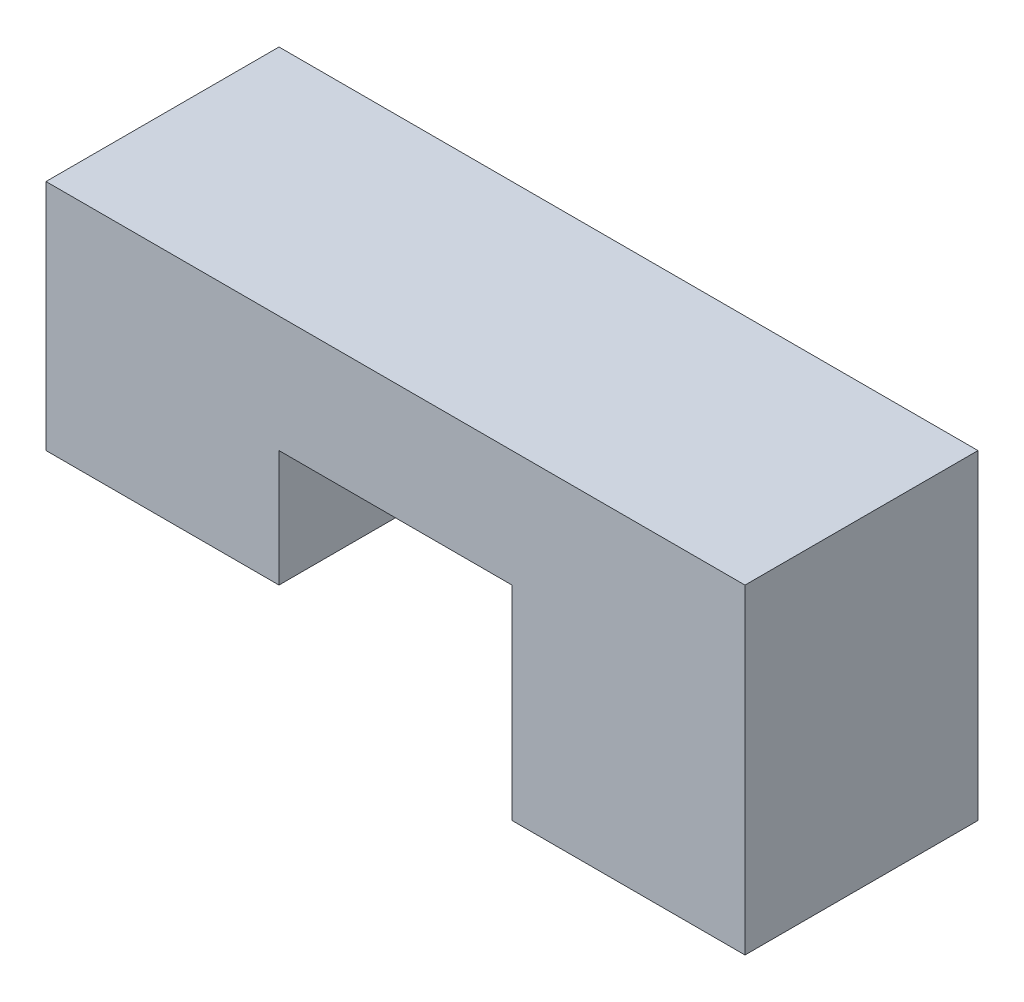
ISO-10303-21;
HEADER;
FILE_DESCRIPTION(('STEP AP214'),'2;1');
FILE_NAME('part.step','',(''),(''),'','','');
FILE_SCHEMA(('AUTOMOTIVE_DESIGN { 1 0 10303 214 1 1 1 1 }'));
ENDSEC;
DATA;
#1=APPLICATION_CONTEXT('core data for automotive mechanical design processes');
#2=APPLICATION_PROTOCOL_DEFINITION('international standard','automotive_design',2000,#1);
#3=PRODUCT_CONTEXT('',#1,'mechanical');
#4=PRODUCT('Part','Part','',(#3));
#5=PRODUCT_RELATED_PRODUCT_CATEGORY('part','',(#4));
#6=PRODUCT_DEFINITION_FORMATION('','',#4);
#7=PRODUCT_DEFINITION_CONTEXT('part definition',#1,'design');
#8=PRODUCT_DEFINITION('design','',#6,#7);
#9=PRODUCT_DEFINITION_SHAPE('','',#8);
#10=(LENGTH_UNIT() NAMED_UNIT(*) SI_UNIT(.MILLI.,.METRE.));
#11=(NAMED_UNIT(*) PLANE_ANGLE_UNIT() SI_UNIT($,.RADIAN.));
#12=(NAMED_UNIT(*) SI_UNIT($,.STERADIAN.) SOLID_ANGLE_UNIT());
#13=UNCERTAINTY_MEASURE_WITH_UNIT(LENGTH_MEASURE(1.E-05),#10,'distance_accuracy_value','');
#14=(GEOMETRIC_REPRESENTATION_CONTEXT(3) GLOBAL_UNCERTAINTY_ASSIGNED_CONTEXT((#13)) GLOBAL_UNIT_ASSIGNED_CONTEXT((#10,
#11,#12)) REPRESENTATION_CONTEXT('',''));
#15=CARTESIAN_POINT('',(0.,0.,0.));
#16=DIRECTION('',(0.,0.,1.));
#17=DIRECTION('',(1.,0.,0.));
#18=AXIS2_PLACEMENT_3D('',#15,#16,#17);
#19=CARTESIAN_POINT('',(-60.,-20.,20.));
#20=DIRECTION('',(-1.,0.,0.));
#21=DIRECTION('',(0.,0.,1.));
#22=AXIS2_PLACEMENT_3D('',#19,#20,#21);
#23=PLANE('',#22);
#24=DIRECTION('',(0.,0.,1.));
#25=VECTOR('',#24,1.);
#26=CARTESIAN_POINT('',(-60.,0.,20.));
#27=LINE('',#26,#25);
#28=CARTESIAN_POINT('',(-60.,0.,-20.));
#29=VERTEX_POINT('',#28);
#30=CARTESIAN_POINT('',(-60.,0.,20.));
#31=VERTEX_POINT('',#30);
#32=EDGE_CURVE('E144',#29,#31,#27,.T.);
#33=ORIENTED_EDGE('',*,*,#32,.F.);
#34=DIRECTION('',(0.,1.,0.));
#35=VECTOR('',#34,1.);
#36=CARTESIAN_POINT('',(-60.,-20.,-20.));
#37=LINE('',#36,#35);
#38=CARTESIAN_POINT('',(-60.,-40.,-20.));
#39=VERTEX_POINT('',#38);
#40=EDGE_CURVE('E157',#39,#29,#37,.T.);
#41=ORIENTED_EDGE('',*,*,#40,.F.);
#42=DIRECTION('',(0.,0.,1.));
#43=VECTOR('',#42,1.);
#44=CARTESIAN_POINT('',(-60.,-40.,20.));
#45=LINE('',#44,#43);
#46=CARTESIAN_POINT('',(-60.,-40.,20.));
#47=VERTEX_POINT('',#46);
#48=EDGE_CURVE('E126',#39,#47,#45,.T.);
#49=ORIENTED_EDGE('',*,*,#48,.T.);
#50=DIRECTION('',(0.,1.,0.));
#51=VECTOR('',#50,1.);
#52=CARTESIAN_POINT('',(-60.,-20.,20.));
#53=LINE('',#52,#51);
#54=EDGE_CURVE('E147',#47,#31,#53,.T.);
#55=ORIENTED_EDGE('',*,*,#54,.T.);
#56=EDGE_LOOP('',(#33,#41,#49,#55));
#57=FACE_BOUND('',#56,.T.);
#58=ADVANCED_FACE('F39',(#57),#23,.T.);
#59=CARTESIAN_POINT('',(-60.,-20.,-20.));
#60=DIRECTION('',(0.,0.,-1.));
#61=DIRECTION('',(-1.,0.,0.));
#62=AXIS2_PLACEMENT_3D('',#59,#60,#61);
#63=PLANE('',#62);
#64=ORIENTED_EDGE('',*,*,#40,.T.);
#65=DIRECTION('',(-1.,0.,0.));
#66=VECTOR('',#65,1.);
#67=CARTESIAN_POINT('',(-60.,0.,-20.));
#68=LINE('',#67,#66);
#69=CARTESIAN_POINT('',(60.,0.,-20.));
#70=VERTEX_POINT('',#69);
#71=EDGE_CURVE('E146',#70,#29,#68,.T.);
#72=ORIENTED_EDGE('',*,*,#71,.F.);
#73=DIRECTION('',(0.,1.,0.));
#74=VECTOR('',#73,1.);
#75=CARTESIAN_POINT('',(60.,-20.,-20.));
#76=LINE('',#75,#74);
#77=CARTESIAN_POINT('',(60.,-55.,-20.));
#78=VERTEX_POINT('',#77);
#79=EDGE_CURVE('E165',#78,#70,#76,.T.);
#80=ORIENTED_EDGE('',*,*,#79,.F.);
#81=DIRECTION('',(-1.,0.,0.));
#82=VECTOR('',#81,1.);
#83=CARTESIAN_POINT('',(20.,-55.,-20.));
#84=LINE('',#83,#82);
#85=CARTESIAN_POINT('',(20.,-55.,-20.));
#86=VERTEX_POINT('',#85);
#87=EDGE_CURVE('E112',#78,#86,#84,.T.);
#88=ORIENTED_EDGE('',*,*,#87,.T.);
#89=DIRECTION('',(0.,1.,0.));
#90=VECTOR('',#89,1.);
#91=CARTESIAN_POINT('',(20.,-55.,-20.));
#92=LINE('',#91,#90);
#93=CARTESIAN_POINT('',(20.,-20.,-20.));
#94=VERTEX_POINT('',#93);
#95=EDGE_CURVE('E109',#86,#94,#92,.T.);
#96=ORIENTED_EDGE('',*,*,#95,.T.);
#97=DIRECTION('',(-1.,0.,0.));
#98=VECTOR('',#97,1.);
#99=CARTESIAN_POINT('',(-60.,-20.,-20.));
#100=LINE('',#99,#98);
#101=CARTESIAN_POINT('',(-20.,-20.,-20.));
#102=VERTEX_POINT('',#101);
#103=EDGE_CURVE('E59',#94,#102,#100,.T.);
#104=ORIENTED_EDGE('',*,*,#103,.T.);
#105=DIRECTION('',(0.,1.,0.));
#106=VECTOR('',#105,1.);
#107=CARTESIAN_POINT('',(-20.,-40.,-20.));
#108=LINE('',#107,#106);
#109=CARTESIAN_POINT('',(-20.,-40.,-20.));
#110=VERTEX_POINT('',#109);
#111=EDGE_CURVE('E142',#110,#102,#108,.T.);
#112=ORIENTED_EDGE('',*,*,#111,.F.);
#113=DIRECTION('',(-1.,0.,0.));
#114=VECTOR('',#113,1.);
#115=CARTESIAN_POINT('',(-60.,-40.,-20.));
#116=LINE('',#115,#114);
#117=EDGE_CURVE('E137',#110,#39,#116,.T.);
#118=ORIENTED_EDGE('',*,*,#117,.T.);
#119=EDGE_LOOP('',(#64,#72,#80,#88,#96,#104,#112,#118));
#120=FACE_BOUND('',#119,.T.);
#121=ADVANCED_FACE('F179',(#120),#63,.T.);
#122=CARTESIAN_POINT('',(60.,-20.,20.));
#123=DIRECTION('',(1.,0.,0.));
#124=DIRECTION('',(0.,0.,-1.));
#125=AXIS2_PLACEMENT_3D('',#122,#123,#124);
#126=PLANE('',#125);
#127=DIRECTION('',(0.,0.,-1.));
#128=VECTOR('',#127,1.);
#129=CARTESIAN_POINT('',(60.,0.,20.));
#130=LINE('',#129,#128);
#131=CARTESIAN_POINT('',(60.,0.,20.));
#132=VERTEX_POINT('',#131);
#133=EDGE_CURVE('E154',#132,#70,#130,.T.);
#134=ORIENTED_EDGE('',*,*,#133,.F.);
#135=DIRECTION('',(0.,1.,0.));
#136=VECTOR('',#135,1.);
#137=CARTESIAN_POINT('',(60.,-20.,20.));
#138=LINE('',#137,#136);
#139=CARTESIAN_POINT('',(60.,-55.,20.));
#140=VERTEX_POINT('',#139);
#141=EDGE_CURVE('E163',#140,#132,#138,.T.);
#142=ORIENTED_EDGE('',*,*,#141,.F.);
#143=DIRECTION('',(0.,0.,-1.));
#144=VECTOR('',#143,1.);
#145=CARTESIAN_POINT('',(60.,-55.,20.));
#146=LINE('',#145,#144);
#147=EDGE_CURVE('E123',#140,#78,#146,.T.);
#148=ORIENTED_EDGE('',*,*,#147,.T.);
#149=ORIENTED_EDGE('',*,*,#79,.T.);
#150=EDGE_LOOP('',(#134,#142,#148,#149));
#151=FACE_BOUND('',#150,.T.);
#152=ADVANCED_FACE('F184',(#151),#126,.T.);
#153=CARTESIAN_POINT('',(-60.,-20.,20.));
#154=DIRECTION('',(0.,0.,1.));
#155=DIRECTION('',(1.,0.,0.));
#156=AXIS2_PLACEMENT_3D('',#153,#154,#155);
#157=PLANE('',#156);
#158=ORIENTED_EDGE('',*,*,#141,.T.);
#159=DIRECTION('',(1.,0.,0.));
#160=VECTOR('',#159,1.);
#161=CARTESIAN_POINT('',(-60.,0.,20.));
#162=LINE('',#161,#160);
#163=EDGE_CURVE('E153',#31,#132,#162,.T.);
#164=ORIENTED_EDGE('',*,*,#163,.F.);
#165=ORIENTED_EDGE('',*,*,#54,.F.);
#166=DIRECTION('',(1.,0.,0.));
#167=VECTOR('',#166,1.);
#168=CARTESIAN_POINT('',(-60.,-40.,20.));
#169=LINE('',#168,#167);
#170=CARTESIAN_POINT('',(-20.,-40.,20.));
#171=VERTEX_POINT('',#170);
#172=EDGE_CURVE('E134',#47,#171,#169,.T.);
#173=ORIENTED_EDGE('',*,*,#172,.T.);
#174=DIRECTION('',(0.,1.,0.));
#175=VECTOR('',#174,1.);
#176=CARTESIAN_POINT('',(-20.,-40.,20.));
#177=LINE('',#176,#175);
#178=CARTESIAN_POINT('',(-20.,-20.,20.));
#179=VERTEX_POINT('',#178);
#180=EDGE_CURVE('E143',#171,#179,#177,.T.);
#181=ORIENTED_EDGE('',*,*,#180,.T.);
#182=DIRECTION('',(1.,0.,0.));
#183=VECTOR('',#182,1.);
#184=CARTESIAN_POINT('',(-60.,-20.,20.));
#185=LINE('',#184,#183);
#186=CARTESIAN_POINT('',(20.,-20.,20.));
#187=VERTEX_POINT('',#186);
#188=EDGE_CURVE('E110',#179,#187,#185,.T.);
#189=ORIENTED_EDGE('',*,*,#188,.T.);
#190=DIRECTION('',(0.,1.,0.));
#191=VECTOR('',#190,1.);
#192=CARTESIAN_POINT('',(20.,-55.,20.));
#193=LINE('',#192,#191);
#194=CARTESIAN_POINT('',(20.,-55.,20.));
#195=VERTEX_POINT('',#194);
#196=EDGE_CURVE('E101',#195,#187,#193,.T.);
#197=ORIENTED_EDGE('',*,*,#196,.F.);
#198=DIRECTION('',(1.,0.,0.));
#199=VECTOR('',#198,1.);
#200=CARTESIAN_POINT('',(20.,-55.,20.));
#201=LINE('',#200,#199);
#202=EDGE_CURVE('E104',#195,#140,#201,.T.);
#203=ORIENTED_EDGE('',*,*,#202,.T.);
#204=EDGE_LOOP('',(#158,#164,#165,#173,#181,#189,#197,#203));
#205=FACE_BOUND('',#204,.T.);
#206=ADVANCED_FACE('F102',(#205),#157,.T.);
#207=CARTESIAN_POINT('',(0.,-20.,0.));
#208=DIRECTION('',(0.,-1.,0.));
#209=DIRECTION('',(0.,0.,-1.));
#210=AXIS2_PLACEMENT_3D('',#207,#208,#209);
#211=PLANE('',#210);
#212=DIRECTION('',(0.,0.,-1.));
#213=VECTOR('',#212,1.);
#214=CARTESIAN_POINT('',(20.,-20.,0.));
#215=LINE('',#214,#213);
#216=EDGE_CURVE('E11',#187,#94,#215,.T.);
#217=ORIENTED_EDGE('',*,*,#216,.F.);
#218=ORIENTED_EDGE('',*,*,#188,.F.);
#219=DIRECTION('',(0.,0.,1.));
#220=VECTOR('',#219,1.);
#221=CARTESIAN_POINT('',(-20.,-20.,0.));
#222=LINE('',#221,#220);
#223=EDGE_CURVE('E46',#102,#179,#222,.T.);
#224=ORIENTED_EDGE('',*,*,#223,.F.);
#225=ORIENTED_EDGE('',*,*,#103,.F.);
#226=EDGE_LOOP('',(#217,#218,#224,#225));
#227=FACE_BOUND('',#226,.T.);
#228=ADVANCED_FACE('F191',(#227),#211,.T.);
#229=CARTESIAN_POINT('',(0.,0.,0.));
#230=DIRECTION('',(0.,-1.,0.));
#231=DIRECTION('',(0.,0.,-1.));
#232=AXIS2_PLACEMENT_3D('',#229,#230,#231);
#233=PLANE('',#232);
#234=ORIENTED_EDGE('',*,*,#71,.T.);
#235=ORIENTED_EDGE('',*,*,#32,.T.);
#236=ORIENTED_EDGE('',*,*,#163,.T.);
#237=ORIENTED_EDGE('',*,*,#133,.T.);
#238=EDGE_LOOP('',(#234,#235,#236,#237));
#239=FACE_BOUND('',#238,.T.);
#240=ADVANCED_FACE('F182',(#239),#233,.F.);
#241=CARTESIAN_POINT('',(-20.,-40.,20.));
#242=DIRECTION('',(1.,0.,0.));
#243=DIRECTION('',(0.,0.,-1.));
#244=AXIS2_PLACEMENT_3D('',#241,#242,#243);
#245=PLANE('',#244);
#246=ORIENTED_EDGE('',*,*,#111,.T.);
#247=ORIENTED_EDGE('',*,*,#223,.T.);
#248=ORIENTED_EDGE('',*,*,#180,.F.);
#249=DIRECTION('',(0.,0.,-1.));
#250=VECTOR('',#249,1.);
#251=CARTESIAN_POINT('',(-20.,-40.,20.));
#252=LINE('',#251,#250);
#253=EDGE_CURVE('E131',#171,#110,#252,.T.);
#254=ORIENTED_EDGE('',*,*,#253,.T.);
#255=EDGE_LOOP('',(#246,#247,#248,#254));
#256=FACE_BOUND('',#255,.T.);
#257=ADVANCED_FACE('F169',(#256),#245,.T.);
#258=CARTESIAN_POINT('',(0.,-40.,0.));
#259=DIRECTION('',(0.,-1.,0.));
#260=DIRECTION('',(0.,0.,-1.));
#261=AXIS2_PLACEMENT_3D('',#258,#259,#260);
#262=PLANE('',#261);
#263=ORIENTED_EDGE('',*,*,#48,.F.);
#264=ORIENTED_EDGE('',*,*,#117,.F.);
#265=ORIENTED_EDGE('',*,*,#253,.F.);
#266=ORIENTED_EDGE('',*,*,#172,.F.);
#267=EDGE_LOOP('',(#263,#264,#265,#266));
#268=FACE_BOUND('',#267,.T.);
#269=ADVANCED_FACE('F175',(#268),#262,.T.);
#270=CARTESIAN_POINT('',(20.,-55.,20.));
#271=DIRECTION('',(-1.,0.,0.));
#272=DIRECTION('',(0.,0.,1.));
#273=AXIS2_PLACEMENT_3D('',#270,#271,#272);
#274=PLANE('',#273);
#275=ORIENTED_EDGE('',*,*,#196,.T.);
#276=ORIENTED_EDGE('',*,*,#216,.T.);
#277=ORIENTED_EDGE('',*,*,#95,.F.);
#278=DIRECTION('',(0.,0.,1.));
#279=VECTOR('',#278,1.);
#280=CARTESIAN_POINT('',(20.,-55.,20.));
#281=LINE('',#280,#279);
#282=EDGE_CURVE('E117',#86,#195,#281,.T.);
#283=ORIENTED_EDGE('',*,*,#282,.T.);
#284=EDGE_LOOP('',(#275,#276,#277,#283));
#285=FACE_BOUND('',#284,.T.);
#286=ADVANCED_FACE('F121',(#285),#274,.T.);
#287=CARTESIAN_POINT('',(0.,-55.,0.));
#288=DIRECTION('',(0.,-1.,0.));
#289=DIRECTION('',(0.,0.,-1.));
#290=AXIS2_PLACEMENT_3D('',#287,#288,#289);
#291=PLANE('',#290);
#292=ORIENTED_EDGE('',*,*,#282,.F.);
#293=ORIENTED_EDGE('',*,*,#87,.F.);
#294=ORIENTED_EDGE('',*,*,#147,.F.);
#295=ORIENTED_EDGE('',*,*,#202,.F.);
#296=EDGE_LOOP('',(#292,#293,#294,#295));
#297=FACE_BOUND('',#296,.T.);
#298=ADVANCED_FACE('F118',(#297),#291,.T.);
#299=CLOSED_SHELL('',(#58,#121,#152,#206,#228,#240,#257,#269,#286,#298));
#300=MANIFOLD_SOLID_BREP('B2',#299);
#301=ADVANCED_BREP_SHAPE_REPRESENTATION('',(#18,#300),#14);
#302=SHAPE_DEFINITION_REPRESENTATION(#9,#301);
ENDSEC;
END-ISO-10303-21;
